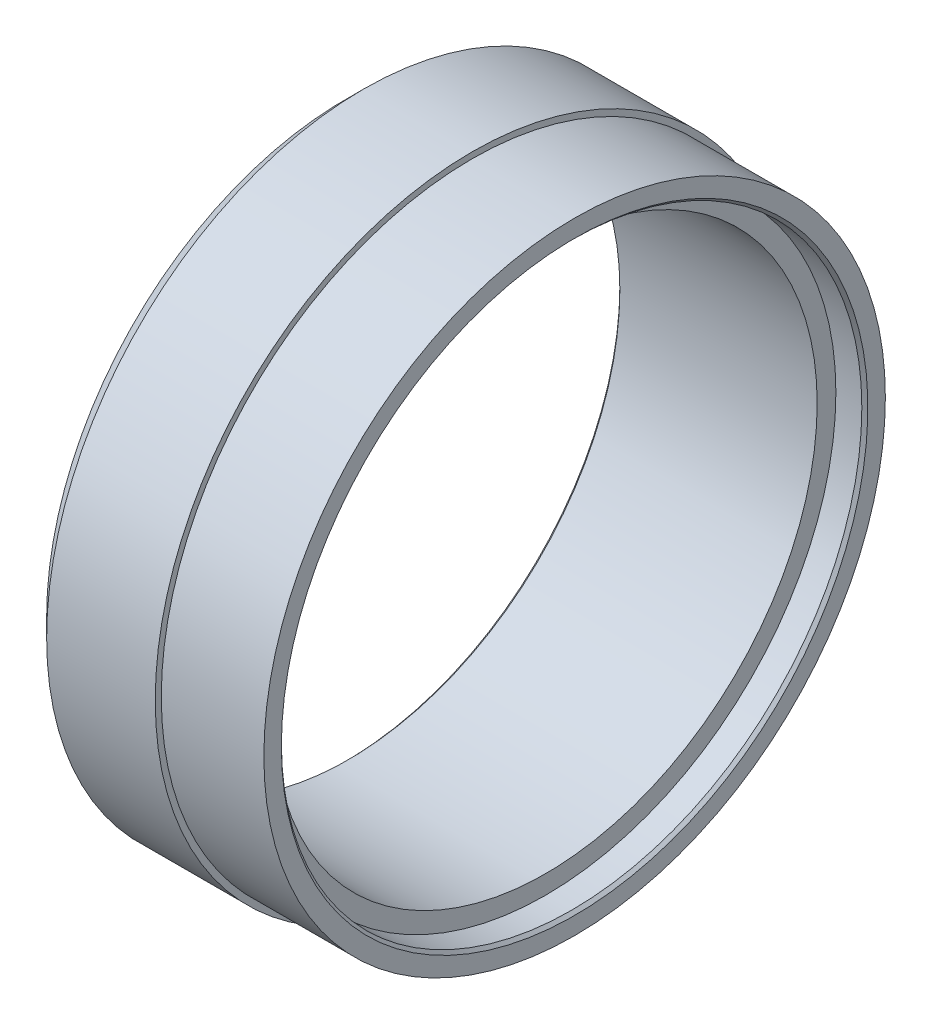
ISO-10303-21;
HEADER;
FILE_DESCRIPTION(('STEP AP214'),'2;1');
FILE_NAME('part.step','',(''),(''),'','','');
FILE_SCHEMA(('AUTOMOTIVE_DESIGN { 1 0 10303 214 1 1 1 1 }'));
ENDSEC;
DATA;
#1=APPLICATION_CONTEXT('core data for automotive mechanical design processes');
#2=APPLICATION_PROTOCOL_DEFINITION('international standard','automotive_design',2000,#1);
#3=PRODUCT_CONTEXT('',#1,'mechanical');
#4=PRODUCT('Part','Part','',(#3));
#5=PRODUCT_RELATED_PRODUCT_CATEGORY('part','',(#4));
#6=PRODUCT_DEFINITION_FORMATION('','',#4);
#7=PRODUCT_DEFINITION_CONTEXT('part definition',#1,'design');
#8=PRODUCT_DEFINITION('design','',#6,#7);
#9=PRODUCT_DEFINITION_SHAPE('','',#8);
#10=(LENGTH_UNIT() NAMED_UNIT(*) SI_UNIT(.MILLI.,.METRE.));
#11=(NAMED_UNIT(*) PLANE_ANGLE_UNIT() SI_UNIT($,.RADIAN.));
#12=(NAMED_UNIT(*) SI_UNIT($,.STERADIAN.) SOLID_ANGLE_UNIT());
#13=UNCERTAINTY_MEASURE_WITH_UNIT(LENGTH_MEASURE(1.E-05),#10,'distance_accuracy_value','');
#14=(GEOMETRIC_REPRESENTATION_CONTEXT(3) GLOBAL_UNCERTAINTY_ASSIGNED_CONTEXT((#13)) GLOBAL_UNIT_ASSIGNED_CONTEXT((#10,
#11,#12)) REPRESENTATION_CONTEXT('',''));
#15=CARTESIAN_POINT('',(0.,0.,0.));
#16=DIRECTION('',(0.,0.,1.));
#17=DIRECTION('',(1.,0.,0.));
#18=AXIS2_PLACEMENT_3D('',#15,#16,#17);
#19=CARTESIAN_POINT('',(0.,0.,0.));
#20=DIRECTION('',(-1.,0.,0.));
#21=DIRECTION('',(0.,0.,1.));
#22=AXIS2_PLACEMENT_3D('',#19,#20,#21);
#23=CYLINDRICAL_SURFACE('',#22,52.5);
#24=CARTESIAN_POINT('',(3.00000000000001,0.,0.));
#25=DIRECTION('',(1.,0.,0.));
#26=DIRECTION('',(0.,0.,-1.));
#27=AXIS2_PLACEMENT_3D('',#24,#25,#26);
#28=CIRCLE('',#27,52.5);
#29=CARTESIAN_POINT('',(3.00000000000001,0.,-52.5));
#30=VERTEX_POINT('',#29);
#31=EDGE_CURVE('E53',#30,#30,#28,.T.);
#32=ORIENTED_EDGE('',*,*,#31,.T.);
#33=EDGE_LOOP('',(#32));
#34=FACE_BOUND('',#33,.T.);
#35=CARTESIAN_POINT('',(21.,0.,0.));
#36=DIRECTION('',(-1.,0.,0.));
#37=DIRECTION('',(0.,0.,1.));
#38=AXIS2_PLACEMENT_3D('',#35,#36,#37);
#39=CIRCLE('',#38,52.5);
#40=CARTESIAN_POINT('',(21.,0.,52.5));
#41=VERTEX_POINT('',#40);
#42=EDGE_CURVE('E59',#41,#41,#39,.T.);
#43=ORIENTED_EDGE('',*,*,#42,.T.);
#44=EDGE_LOOP('',(#43));
#45=FACE_BOUND('',#44,.T.);
#46=ADVANCED_FACE('F33',(#34,#45),#23,.T.);
#47=CARTESIAN_POINT('',(21.,52.5,0.));
#48=DIRECTION('',(-1.,0.,0.));
#49=DIRECTION('',(0.,0.,1.));
#50=AXIS2_PLACEMENT_3D('',#47,#48,#49);
#51=PLANE('',#50);
#52=ORIENTED_EDGE('',*,*,#42,.F.);
#53=EDGE_LOOP('',(#52));
#54=FACE_BOUND('',#53,.T.);
#55=CARTESIAN_POINT('',(21.,0.,0.));
#56=DIRECTION('',(-1.,0.,0.));
#57=DIRECTION('',(0.,0.,1.));
#58=AXIS2_PLACEMENT_3D('',#55,#56,#57);
#59=CIRCLE('',#58,51.5);
#60=CARTESIAN_POINT('',(21.,0.,51.5));
#61=VERTEX_POINT('',#60);
#62=EDGE_CURVE('E62',#61,#61,#59,.T.);
#63=ORIENTED_EDGE('',*,*,#62,.T.);
#64=EDGE_LOOP('',(#63));
#65=FACE_BOUND('',#64,.T.);
#66=ADVANCED_FACE('F91',(#54,#65),#51,.F.);
#67=CARTESIAN_POINT('',(0.,0.,0.));
#68=DIRECTION('',(-1.,0.,0.));
#69=DIRECTION('',(0.,0.,1.));
#70=AXIS2_PLACEMENT_3D('',#67,#68,#69);
#71=CYLINDRICAL_SURFACE('',#70,51.5);
#72=ORIENTED_EDGE('',*,*,#62,.F.);
#73=EDGE_LOOP('',(#72));
#74=FACE_BOUND('',#73,.T.);
#75=CARTESIAN_POINT('',(38.,0.,0.));
#76=DIRECTION('',(-1.,0.,0.));
#77=DIRECTION('',(0.,0.,1.));
#78=AXIS2_PLACEMENT_3D('',#75,#76,#77);
#79=CIRCLE('',#78,51.5);
#80=CARTESIAN_POINT('',(38.,0.,51.5));
#81=VERTEX_POINT('',#80);
#82=EDGE_CURVE('E65',#81,#81,#79,.T.);
#83=ORIENTED_EDGE('',*,*,#82,.T.);
#84=EDGE_LOOP('',(#83));
#85=FACE_BOUND('',#84,.T.);
#86=ADVANCED_FACE('F96',(#74,#85),#71,.T.);
#87=CARTESIAN_POINT('',(38.,51.5,0.));
#88=DIRECTION('',(-1.,0.,0.));
#89=DIRECTION('',(0.,0.,1.));
#90=AXIS2_PLACEMENT_3D('',#87,#88,#89);
#91=PLANE('',#90);
#92=CARTESIAN_POINT('',(38.,0.,0.));
#93=DIRECTION('',(-1.,0.,0.));
#94=DIRECTION('',(0.,0.,1.));
#95=AXIS2_PLACEMENT_3D('',#92,#93,#94);
#96=CIRCLE('',#95,48.6);
#97=CARTESIAN_POINT('',(38.,0.,48.6));
#98=VERTEX_POINT('',#97);
#99=EDGE_CURVE('E47',#98,#98,#96,.T.);
#100=ORIENTED_EDGE('',*,*,#99,.T.);
#101=EDGE_LOOP('',(#100));
#102=FACE_BOUND('',#101,.T.);
#103=ORIENTED_EDGE('',*,*,#82,.F.);
#104=EDGE_LOOP('',(#103));
#105=FACE_BOUND('',#104,.T.);
#106=ADVANCED_FACE('F106',(#102,#105),#91,.F.);
#107=CARTESIAN_POINT('',(0.,0.,0.));
#108=DIRECTION('',(-1.,0.,0.));
#109=DIRECTION('',(0.,0.,1.));
#110=AXIS2_PLACEMENT_3D('',#107,#108,#109);
#111=CYLINDRICAL_SURFACE('',#110,48.1);
#112=CARTESIAN_POINT('',(37.5,0.,0.));
#113=DIRECTION('',(-1.,0.,0.));
#114=DIRECTION('',(0.,0.,1.));
#115=AXIS2_PLACEMENT_3D('',#112,#113,#114);
#116=CIRCLE('',#115,48.1);
#117=CARTESIAN_POINT('',(37.5,0.,48.1));
#118=VERTEX_POINT('',#117);
#119=EDGE_CURVE('E43',#118,#118,#116,.F.);
#120=ORIENTED_EDGE('',*,*,#119,.T.);
#121=EDGE_LOOP('',(#120));
#122=FACE_BOUND('',#121,.T.);
#123=CARTESIAN_POINT('',(33.2,0.,0.));
#124=DIRECTION('',(-1.,0.,0.));
#125=DIRECTION('',(0.,0.,1.));
#126=AXIS2_PLACEMENT_3D('',#123,#124,#125);
#127=CIRCLE('',#126,48.1);
#128=CARTESIAN_POINT('',(33.2,0.,48.1));
#129=VERTEX_POINT('',#128);
#130=EDGE_CURVE('E68',#129,#129,#127,.T.);
#131=ORIENTED_EDGE('',*,*,#130,.T.);
#132=EDGE_LOOP('',(#131));
#133=FACE_BOUND('',#132,.T.);
#134=ADVANCED_FACE('F87',(#122,#133),#111,.F.);
#135=CARTESIAN_POINT('',(33.2,48.1,0.));
#136=DIRECTION('',(-1.,0.,0.));
#137=DIRECTION('',(0.,0.,1.));
#138=AXIS2_PLACEMENT_3D('',#135,#136,#137);
#139=PLANE('',#138);
#140=ORIENTED_EDGE('',*,*,#130,.F.);
#141=EDGE_LOOP('',(#140));
#142=FACE_BOUND('',#141,.T.);
#143=CARTESIAN_POINT('',(33.2,0.,0.));
#144=DIRECTION('',(-1.,0.,0.));
#145=DIRECTION('',(0.,0.,1.));
#146=AXIS2_PLACEMENT_3D('',#143,#144,#145);
#147=CIRCLE('',#146,45.);
#148=CARTESIAN_POINT('',(33.2,0.,45.));
#149=VERTEX_POINT('',#148);
#150=EDGE_CURVE('E71',#149,#149,#147,.T.);
#151=ORIENTED_EDGE('',*,*,#150,.T.);
#152=EDGE_LOOP('',(#151));
#153=FACE_BOUND('',#152,.T.);
#154=ADVANCED_FACE('F75',(#142,#153),#139,.F.);
#155=CARTESIAN_POINT('',(0.,0.,0.));
#156=DIRECTION('',(-1.,0.,0.));
#157=DIRECTION('',(0.,0.,1.));
#158=AXIS2_PLACEMENT_3D('',#155,#156,#157);
#159=CYLINDRICAL_SURFACE('',#158,45.);
#160=CARTESIAN_POINT('',(0.500000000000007,0.,0.));
#161=DIRECTION('',(1.,0.,0.));
#162=DIRECTION('',(0.,0.,-1.));
#163=AXIS2_PLACEMENT_3D('',#160,#161,#162);
#164=CIRCLE('',#163,45.);
#165=CARTESIAN_POINT('',(0.500000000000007,0.,-45.));
#166=VERTEX_POINT('',#165);
#167=EDGE_CURVE('E39',#166,#166,#164,.F.);
#168=ORIENTED_EDGE('',*,*,#167,.T.);
#169=EDGE_LOOP('',(#168));
#170=FACE_BOUND('',#169,.T.);
#171=ORIENTED_EDGE('',*,*,#150,.F.);
#172=EDGE_LOOP('',(#171));
#173=FACE_BOUND('',#172,.T.);
#174=ADVANCED_FACE('F77',(#170,#173),#159,.F.);
#175=CARTESIAN_POINT('',(0.,45.,0.));
#176=DIRECTION('',(1.,0.,0.));
#177=DIRECTION('',(0.,0.,-1.));
#178=AXIS2_PLACEMENT_3D('',#175,#176,#177);
#179=PLANE('',#178);
#180=CARTESIAN_POINT('',(0.,0.,0.));
#181=DIRECTION('',(1.,0.,0.));
#182=DIRECTION('',(0.,0.,-1.));
#183=AXIS2_PLACEMENT_3D('',#180,#181,#182);
#184=CIRCLE('',#183,45.5);
#185=CARTESIAN_POINT('',(0.,0.,-45.5));
#186=VERTEX_POINT('',#185);
#187=EDGE_CURVE('E10',#186,#186,#184,.T.);
#188=ORIENTED_EDGE('',*,*,#187,.T.);
#189=EDGE_LOOP('',(#188));
#190=FACE_BOUND('',#189,.T.);
#191=CARTESIAN_POINT('',(0.,0.,0.));
#192=DIRECTION('',(1.,0.,0.));
#193=DIRECTION('',(0.,0.,-1.));
#194=AXIS2_PLACEMENT_3D('',#191,#192,#193);
#195=CIRCLE('',#194,49.5);
#196=CARTESIAN_POINT('',(0.,0.,-49.5));
#197=VERTEX_POINT('',#196);
#198=EDGE_CURVE('E56',#197,#197,#195,.F.);
#199=ORIENTED_EDGE('',*,*,#198,.T.);
#200=EDGE_LOOP('',(#199));
#201=FACE_BOUND('',#200,.T.);
#202=ADVANCED_FACE('F79',(#190,#201),#179,.F.);
#203=CARTESIAN_POINT('',(0.,0.,0.));
#204=DIRECTION('',(1.,0.,0.));
#205=DIRECTION('',(0.,0.,-1.));
#206=AXIS2_PLACEMENT_3D('',#203,#204,#205);
#207=CONICAL_SURFACE('',#206,49.5,0.785398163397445);
#208=ORIENTED_EDGE('',*,*,#31,.F.);
#209=EDGE_LOOP('',(#208));
#210=FACE_BOUND('',#209,.T.);
#211=ORIENTED_EDGE('',*,*,#198,.F.);
#212=EDGE_LOOP('',(#211));
#213=FACE_BOUND('',#212,.T.);
#214=ADVANCED_FACE('F85',(#210,#213),#207,.T.);
#215=CARTESIAN_POINT('',(38.,0.,0.));
#216=DIRECTION('',(1.,0.,0.));
#217=DIRECTION('',(0.,0.,-1.));
#218=AXIS2_PLACEMENT_3D('',#215,#216,#217);
#219=CONICAL_SURFACE('',#218,48.6,0.785398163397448);
#220=ORIENTED_EDGE('',*,*,#119,.F.);
#221=EDGE_LOOP('',(#220));
#222=FACE_BOUND('',#221,.T.);
#223=ORIENTED_EDGE('',*,*,#99,.F.);
#224=EDGE_LOOP('',(#223));
#225=FACE_BOUND('',#224,.T.);
#226=ADVANCED_FACE('F120',(#222,#225),#219,.F.);
#227=CARTESIAN_POINT('',(0.500000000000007,0.,0.));
#228=DIRECTION('',(-1.,0.,0.));
#229=DIRECTION('',(0.,0.,1.));
#230=AXIS2_PLACEMENT_3D('',#227,#228,#229);
#231=CONICAL_SURFACE('',#230,45.,0.785398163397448);
#232=ORIENTED_EDGE('',*,*,#187,.F.);
#233=EDGE_LOOP('',(#232));
#234=FACE_BOUND('',#233,.T.);
#235=ORIENTED_EDGE('',*,*,#167,.F.);
#236=EDGE_LOOP('',(#235));
#237=FACE_BOUND('',#236,.T.);
#238=ADVANCED_FACE('F122',(#234,#237),#231,.F.);
#239=CLOSED_SHELL('',(#46,#66,#86,#106,#134,#154,#174,#202,#214,#226,#238));
#240=MANIFOLD_SOLID_BREP('B2',#239);
#241=ADVANCED_BREP_SHAPE_REPRESENTATION('',(#18,#240),#14);
#242=SHAPE_DEFINITION_REPRESENTATION(#9,#241);
ENDSEC;
END-ISO-10303-21;
